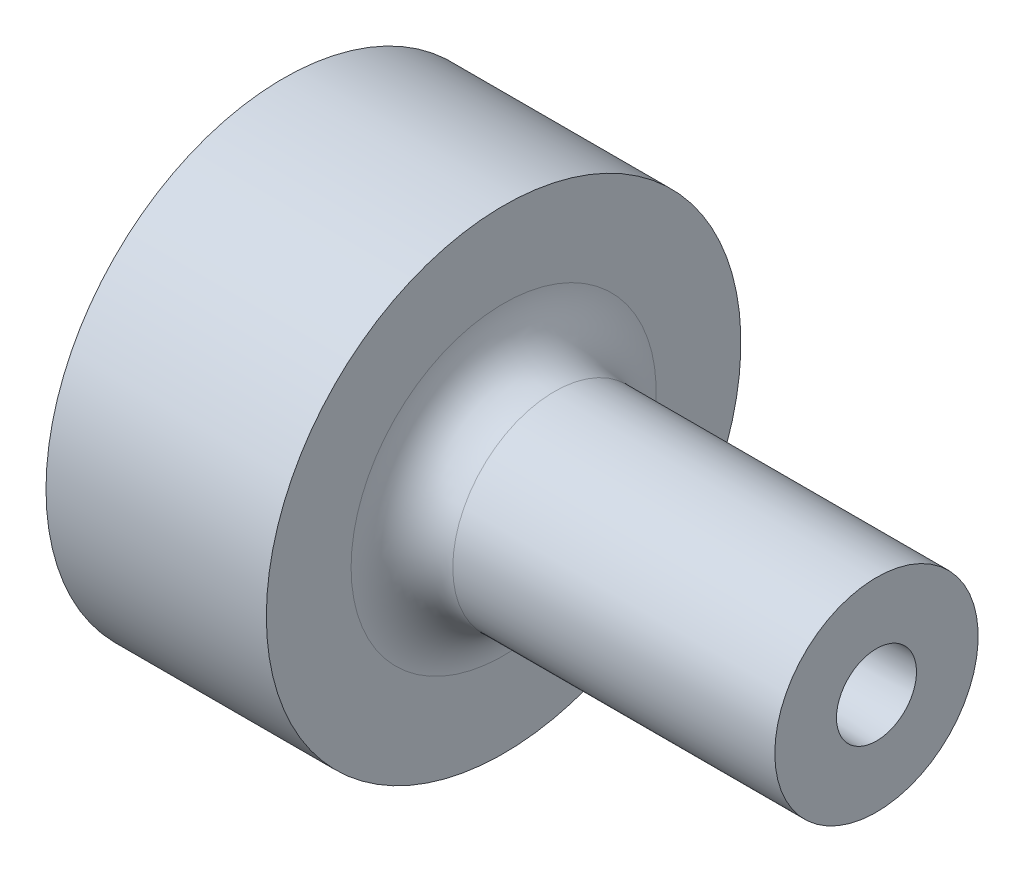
ISO-10303-21;
HEADER;
FILE_DESCRIPTION(('STEP AP214'),'2;1');
FILE_NAME('part.step','',(''),(''),'','','');
FILE_SCHEMA(('AUTOMOTIVE_DESIGN { 1 0 10303 214 1 1 1 1 }'));
ENDSEC;
DATA;
#1=APPLICATION_CONTEXT('core data for automotive mechanical design processes');
#2=APPLICATION_PROTOCOL_DEFINITION('international standard','automotive_design',2000,#1);
#3=PRODUCT_CONTEXT('',#1,'mechanical');
#4=PRODUCT('Part','Part','',(#3));
#5=PRODUCT_RELATED_PRODUCT_CATEGORY('part','',(#4));
#6=PRODUCT_DEFINITION_FORMATION('','',#4);
#7=PRODUCT_DEFINITION_CONTEXT('part definition',#1,'design');
#8=PRODUCT_DEFINITION('design','',#6,#7);
#9=PRODUCT_DEFINITION_SHAPE('','',#8);
#10=(LENGTH_UNIT() NAMED_UNIT(*) SI_UNIT(.MILLI.,.METRE.));
#11=(NAMED_UNIT(*) PLANE_ANGLE_UNIT() SI_UNIT($,.RADIAN.));
#12=(NAMED_UNIT(*) SI_UNIT($,.STERADIAN.) SOLID_ANGLE_UNIT());
#13=UNCERTAINTY_MEASURE_WITH_UNIT(LENGTH_MEASURE(1.E-05),#10,'distance_accuracy_value','');
#14=(GEOMETRIC_REPRESENTATION_CONTEXT(3) GLOBAL_UNCERTAINTY_ASSIGNED_CONTEXT((#13)) GLOBAL_UNIT_ASSIGNED_CONTEXT((#10,
#11,#12)) REPRESENTATION_CONTEXT('',''));
#15=CARTESIAN_POINT('',(0.,0.,0.));
#16=DIRECTION('',(0.,0.,1.));
#17=DIRECTION('',(1.,0.,0.));
#18=AXIS2_PLACEMENT_3D('',#15,#16,#17);
#19=CARTESIAN_POINT('',(0.,0.,0.));
#20=DIRECTION('',(-1.,0.,0.));
#21=DIRECTION('',(0.,0.,1.));
#22=AXIS2_PLACEMENT_3D('',#19,#20,#21);
#23=CYLINDRICAL_SURFACE('',#22,14.);
#24=CARTESIAN_POINT('',(13.,0.,0.));
#25=DIRECTION('',(-1.,0.,0.));
#26=DIRECTION('',(0.,0.,1.));
#27=AXIS2_PLACEMENT_3D('',#24,#25,#26);
#28=CIRCLE('',#27,14.);
#29=CARTESIAN_POINT('',(13.,0.,14.));
#30=VERTEX_POINT('',#29);
#31=EDGE_CURVE('E89',#30,#30,#28,.T.);
#32=ORIENTED_EDGE('',*,*,#31,.T.);
#33=EDGE_LOOP('',(#32));
#34=FACE_BOUND('',#33,.T.);
#35=CARTESIAN_POINT('',(0.,0.,0.));
#36=DIRECTION('',(-1.,0.,0.));
#37=DIRECTION('',(0.,0.,1.));
#38=AXIS2_PLACEMENT_3D('',#35,#36,#37);
#39=CIRCLE('',#38,14.);
#40=CARTESIAN_POINT('',(0.,0.,14.));
#41=VERTEX_POINT('',#40);
#42=EDGE_CURVE('E84',#41,#41,#39,.T.);
#43=ORIENTED_EDGE('',*,*,#42,.F.);
#44=EDGE_LOOP('',(#43));
#45=FACE_BOUND('',#44,.T.);
#46=CARTESIAN_POINT('',(6.5,-13.856406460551,-2.));
#47=CARTESIAN_POINT('',(6.61172417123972,-13.8564082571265,-1.99999534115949));
#48=CARTESIAN_POINT('',(6.72351471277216,-13.8577723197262,-1.99060664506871));
#49=CARTESIAN_POINT('',(6.9439746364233,-13.8630779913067,-1.95330740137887));
#50=CARTESIAN_POINT('',(7.05264079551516,-13.8670221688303,-1.92537839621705));
#51=CARTESIAN_POINT('',(7.26362870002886,-13.8770324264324,-1.85184738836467));
#52=CARTESIAN_POINT('',(7.36595507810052,-13.8830969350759,-1.80625847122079));
#53=CARTESIAN_POINT('',(7.56148972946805,-13.8966626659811,-1.69873175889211));
#54=CARTESIAN_POINT('',(7.65469934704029,-13.9041636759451,-1.63679637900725));
#55=CARTESIAN_POINT('',(7.83004829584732,-13.9198182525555,-1.49785346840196));
#56=CARTESIAN_POINT('',(7.91211171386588,-13.9279757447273,-1.42075056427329));
#57=CARTESIAN_POINT('',(8.06218155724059,-13.9439890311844,-1.25386707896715));
#58=CARTESIAN_POINT('',(8.13018723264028,-13.9518448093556,-1.16408582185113));
#59=CARTESIAN_POINT('',(8.25048909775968,-13.9664103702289,-0.973910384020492));
#60=CARTESIAN_POINT('',(8.30271571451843,-13.9731150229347,-0.873471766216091));
#61=CARTESIAN_POINT('',(8.38953073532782,-13.9845795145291,-0.665136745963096));
#62=CARTESIAN_POINT('',(8.4241199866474,-13.9893394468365,-0.557240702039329));
#63=CARTESIAN_POINT('',(8.47444920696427,-13.9963505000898,-0.337834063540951));
#64=CARTESIAN_POINT('',(8.49031606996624,-13.9986185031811,-0.226353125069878));
#65=CARTESIAN_POINT('',(8.5031438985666,-14.0004479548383,-0.00228956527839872));
#66=CARTESIAN_POINT('',(8.50010582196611,-14.0000095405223,0.110292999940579));
#67=CARTESIAN_POINT('',(8.47531062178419,-13.9964890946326,0.33249899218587));
#68=CARTESIAN_POINT('',(8.45369000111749,-13.9934263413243,0.442137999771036));
#69=CARTESIAN_POINT('',(8.39255744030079,-13.9850228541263,0.656215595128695));
#70=CARTESIAN_POINT('',(8.3530450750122,-13.9796820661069,0.760654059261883));
#71=CARTESIAN_POINT('',(8.25710925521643,-13.9672894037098,0.961781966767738));
#72=CARTESIAN_POINT('',(8.20062784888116,-13.9602316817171,1.05844339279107));
#73=CARTESIAN_POINT('',(8.07239950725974,-13.9451926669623,1.24096782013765));
#74=CARTESIAN_POINT('',(8.00065165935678,-13.9372113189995,1.32683017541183));
#75=CARTESIAN_POINT('',(7.843165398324,-13.921132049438,1.48612299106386));
#76=CARTESIAN_POINT('',(7.75730786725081,-13.9130337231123,1.55943569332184));
#77=CARTESIAN_POINT('',(7.57444547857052,-13.8977029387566,1.69062989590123));
#78=CARTESIAN_POINT('',(7.47744056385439,-13.890470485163,1.74851131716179));
#79=CARTESIAN_POINT('',(7.27491971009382,-13.8776905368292,1.84721301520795));
#80=CARTESIAN_POINT('',(7.1693981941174,-13.8721441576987,1.88802200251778));
#81=CARTESIAN_POINT('',(6.95290242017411,-13.8633846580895,1.9513062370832));
#82=CARTESIAN_POINT('',(6.84192850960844,-13.8601713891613,1.97378265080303));
#83=CARTESIAN_POINT('',(6.61872346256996,-13.8564698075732,1.99960390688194));
#84=CARTESIAN_POINT('',(6.50651197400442,-13.8559577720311,2.00311531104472));
#85=CARTESIAN_POINT('',(6.28310219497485,-13.8576537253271,1.9913480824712));
#86=CARTESIAN_POINT('',(6.17190387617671,-13.8598616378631,1.9760699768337));
#87=CARTESIAN_POINT('',(5.95418781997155,-13.8667269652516,1.92729837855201));
#88=CARTESIAN_POINT('',(5.84765127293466,-13.8713733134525,1.8938871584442));
#89=CARTESIAN_POINT('',(5.6416912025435,-13.8825829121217,1.80988306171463));
#90=CARTESIAN_POINT('',(5.54226800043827,-13.8891462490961,1.75928940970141));
#91=CARTESIAN_POINT('',(5.35260812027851,-13.9035064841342,1.64195360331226));
#92=CARTESIAN_POINT('',(5.26243903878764,-13.911311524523,1.57510320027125));
#93=CARTESIAN_POINT('',(5.09454027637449,-13.9272509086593,1.42730277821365));
#94=CARTESIAN_POINT('',(5.01681123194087,-13.9353852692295,1.34635203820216));
#95=CARTESIAN_POINT('',(4.8754047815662,-13.9511405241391,1.17191708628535));
#96=CARTESIAN_POINT('',(4.81183747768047,-13.9587570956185,1.07834317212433));
#97=CARTESIAN_POINT('',(4.70132443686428,-13.972552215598,0.881748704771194));
#98=CARTESIAN_POINT('',(4.65437828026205,-13.9787308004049,0.778728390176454));
#99=CARTESIAN_POINT('',(4.57861788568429,-13.9889347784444,0.566515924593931));
#100=CARTESIAN_POINT('',(4.54974241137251,-13.9929674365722,0.457345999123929));
#101=CARTESIAN_POINT('',(4.51074453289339,-13.9984555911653,0.235645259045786));
#102=CARTESIAN_POINT('',(4.50062101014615,-13.9999112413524,0.123114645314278));
#103=CARTESIAN_POINT('',(4.49943976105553,-14.0000800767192,-0.101043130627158));
#104=CARTESIAN_POINT('',(4.50821318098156,-13.998817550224,-0.212669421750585));
#105=CARTESIAN_POINT('',(4.54421615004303,-13.9937406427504,-0.432842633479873));
#106=CARTESIAN_POINT('',(4.57144565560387,-13.989926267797,-0.541389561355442));
#107=CARTESIAN_POINT('',(4.6435299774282,-13.9801722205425,-0.752283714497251));
#108=CARTESIAN_POINT('',(4.68837418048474,-13.9742338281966,-0.854634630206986));
#109=CARTESIAN_POINT('',(4.79439714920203,-13.960885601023,-1.05038570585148));
#110=CARTESIAN_POINT('',(4.8555763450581,-13.9534757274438,-1.14378562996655));
#111=CARTESIAN_POINT('',(4.99314771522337,-13.9379304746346,-1.31984194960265));
#112=CARTESIAN_POINT('',(5.06966490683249,-13.9297894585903,-1.40240016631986));
#113=CARTESIAN_POINT('',(5.2354775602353,-13.9137422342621,-1.55356716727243));
#114=CARTESIAN_POINT('',(5.32477602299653,-13.9058360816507,-1.6221726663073));
#115=CARTESIAN_POINT('',(5.51414543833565,-13.8911108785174,-1.74379523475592));
#116=CARTESIAN_POINT('',(5.61426869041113,-13.8842975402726,-1.79673154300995));
#117=CARTESIAN_POINT('',(5.82203229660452,-13.8725962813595,-1.88495902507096));
#118=CARTESIAN_POINT('',(5.92966459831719,-13.8677063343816,-1.92026877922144));
#119=CARTESIAN_POINT('',(6.11483642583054,-13.8615529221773,-1.96409255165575));
#120=CARTESIAN_POINT('',(6.19122433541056,-13.859633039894,-1.97753762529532));
#121=CARTESIAN_POINT('',(6.34506419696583,-13.857059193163,-1.99549291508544));
#122=CARTESIAN_POINT('',(6.42251613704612,-13.8564052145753,-2.00000323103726));
#123=CARTESIAN_POINT('',(6.5,-13.856406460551,-2.));
#124=B_SPLINE_CURVE_WITH_KNOTS('',3,(#46,#47,#48,#49,#50,#51,#52,#53,#54,#55,#56,#57,#58,#59,
#60,#61,#62,#63,#64,#65,#66,#67,#68,#69,#70,#71,#72,#73,#74,#75,#76,#77,#78,#79,#80,#81,#82,#83,
#84,#85,#86,#87,#88,#89,#90,#91,#92,#93,#94,#95,#96,#97,#98,#99,#100,#101,#102,#103,#104,#105,
#106,#107,#108,#109,#110,#111,#112,#113,#114,#115,#116,#117,#118,#119,#120,#121,#122,#123),
.UNSPECIFIED.,.T.,.F.,(4,2,2,2,2,2,2,2,2,2,2,2,2,2,2,2,2,2,2,2,2,2,2,2,2,2,2,2,2,2,2,2,2,2,2,2,
2,2,4),(0.,0.334889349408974,0.670112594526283,1.00508792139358,1.34001378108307,
1.6771171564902,2.01423851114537,2.35282530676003,2.6913958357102,3.02765822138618,
3.36390357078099,3.69769984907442,4.03150405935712,4.36646147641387,4.70143892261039,
5.03940517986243,5.37737316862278,5.7155642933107,6.05373389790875,6.3889286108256,
6.72411392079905,7.05779100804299,7.39148315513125,7.72746121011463,8.06345644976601,
8.40197921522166,8.74049343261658,9.07785422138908,9.41519488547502,9.74953375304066,
10.083871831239,10.4180087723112,10.7521545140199,11.0891434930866,11.426211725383,
11.7649881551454,12.103406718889,12.3356645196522,12.5679197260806),.UNSPECIFIED.);
#125=CARTESIAN_POINT('',(6.5,-13.856406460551,-2.));
#126=VERTEX_POINT('',#125);
#127=EDGE_CURVE('E10',#126,#126,#124,.T.);
#128=ORIENTED_EDGE('',*,*,#127,.F.);
#129=EDGE_LOOP('',(#128));
#130=FACE_BOUND('',#129,.T.);
#131=ADVANCED_FACE('F16',(#34,#45,#130),#23,.T.);
#132=CARTESIAN_POINT('',(0.,0.,0.));
#133=DIRECTION('',(1.,0.,0.));
#134=DIRECTION('',(0.,0.,-1.));
#135=AXIS2_PLACEMENT_3D('',#132,#133,#134);
#136=CONICAL_SURFACE('',#135,1.75,0.0174532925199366);
#137=CARTESIAN_POINT('',(35.,0.,0.));
#138=DIRECTION('',(-1.,0.,0.));
#139=DIRECTION('',(0.,0.,1.));
#140=AXIS2_PLACEMENT_3D('',#137,#138,#139);
#141=CIRCLE('',#140,2.36092727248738);
#142=CARTESIAN_POINT('',(35.,0.,2.36092727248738));
#143=VERTEX_POINT('',#142);
#144=EDGE_CURVE('E81',#143,#143,#141,.T.);
#145=ORIENTED_EDGE('',*,*,#144,.F.);
#146=EDGE_LOOP('',(#145));
#147=FACE_BOUND('',#146,.T.);
#148=CARTESIAN_POINT('',(1.08679639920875,0.,0.));
#149=DIRECTION('',(-1.,0.,0.));
#150=DIRECTION('',(0.,0.,1.));
#151=AXIS2_PLACEMENT_3D('',#148,#149,#150);
#152=CIRCLE('',#151,1.76897010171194);
#153=CARTESIAN_POINT('',(1.08679639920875,0.,1.76897010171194));
#154=VERTEX_POINT('',#153);
#155=EDGE_CURVE('E94',#154,#154,#152,.F.);
#156=ORIENTED_EDGE('',*,*,#155,.F.);
#157=EDGE_LOOP('',(#156));
#158=FACE_BOUND('',#157,.T.);
#159=ADVANCED_FACE('F45',(#147,#158),#136,.F.);
#160=CARTESIAN_POINT('',(16.,0.,0.));
#161=DIRECTION('',(-1.,0.,0.));
#162=DIRECTION('',(0.,0.,1.));
#163=AXIS2_PLACEMENT_3D('',#160,#161,#162);
#164=TOROIDAL_SURFACE('',#163,9.,3.);
#165=CARTESIAN_POINT('',(13.,0.,0.));
#166=DIRECTION('',(-1.,0.,0.));
#167=DIRECTION('',(0.,0.,1.));
#168=AXIS2_PLACEMENT_3D('',#165,#166,#167);
#169=CIRCLE('',#168,9.);
#170=CARTESIAN_POINT('',(13.,0.,9.));
#171=VERTEX_POINT('',#170);
#172=EDGE_CURVE('E91',#171,#171,#169,.T.);
#173=ORIENTED_EDGE('',*,*,#172,.F.);
#174=EDGE_LOOP('',(#173));
#175=FACE_BOUND('',#174,.T.);
#176=CARTESIAN_POINT('',(16.,0.,0.));
#177=DIRECTION('',(-1.,0.,0.));
#178=DIRECTION('',(0.,0.,1.));
#179=AXIS2_PLACEMENT_3D('',#176,#177,#178);
#180=CIRCLE('',#179,6.);
#181=CARTESIAN_POINT('',(16.,0.,6.));
#182=VERTEX_POINT('',#181);
#183=EDGE_CURVE('E28',#182,#182,#180,.T.);
#184=ORIENTED_EDGE('',*,*,#183,.T.);
#185=EDGE_LOOP('',(#184));
#186=FACE_BOUND('',#185,.T.);
#187=ADVANCED_FACE('F18',(#175,#186),#164,.F.);
#188=CARTESIAN_POINT('',(0.,0.,0.));
#189=DIRECTION('',(-1.,0.,0.));
#190=DIRECTION('',(0.,0.,1.));
#191=AXIS2_PLACEMENT_3D('',#188,#189,#190);
#192=CYLINDRICAL_SURFACE('',#191,6.);
#193=ORIENTED_EDGE('',*,*,#183,.F.);
#194=EDGE_LOOP('',(#193));
#195=FACE_BOUND('',#194,.T.);
#196=CARTESIAN_POINT('',(35.,0.,0.));
#197=DIRECTION('',(-1.,0.,0.));
#198=DIRECTION('',(0.,0.,1.));
#199=AXIS2_PLACEMENT_3D('',#196,#197,#198);
#200=CIRCLE('',#199,6.);
#201=CARTESIAN_POINT('',(35.,0.,6.));
#202=VERTEX_POINT('',#201);
#203=EDGE_CURVE('E80',#202,#202,#200,.T.);
#204=ORIENTED_EDGE('',*,*,#203,.T.);
#205=EDGE_LOOP('',(#204));
#206=FACE_BOUND('',#205,.T.);
#207=ADVANCED_FACE('F66',(#195,#206),#192,.T.);
#208=CARTESIAN_POINT('',(35.,6.,0.));
#209=DIRECTION('',(-1.,0.,0.));
#210=DIRECTION('',(0.,0.,1.));
#211=AXIS2_PLACEMENT_3D('',#208,#209,#210);
#212=PLANE('',#211);
#213=ORIENTED_EDGE('',*,*,#203,.F.);
#214=EDGE_LOOP('',(#213));
#215=FACE_BOUND('',#214,.T.);
#216=ORIENTED_EDGE('',*,*,#144,.T.);
#217=EDGE_LOOP('',(#216));
#218=FACE_BOUND('',#217,.T.);
#219=ADVANCED_FACE('F62',(#215,#218),#212,.F.);
#220=CARTESIAN_POINT('',(0.,1.75,0.));
#221=DIRECTION('',(1.,0.,0.));
#222=DIRECTION('',(0.,0.,-1.));
#223=AXIS2_PLACEMENT_3D('',#220,#221,#222);
#224=PLANE('',#223);
#225=CARTESIAN_POINT('',(0.,0.,0.));
#226=DIRECTION('',(-1.,0.,0.));
#227=DIRECTION('',(0.,0.,1.));
#228=AXIS2_PLACEMENT_3D('',#225,#226,#227);
#229=CIRCLE('',#228,5.);
#230=CARTESIAN_POINT('',(0.,0.,5.));
#231=VERTEX_POINT('',#230);
#232=EDGE_CURVE('E97',#231,#231,#229,.T.);
#233=ORIENTED_EDGE('',*,*,#232,.F.);
#234=EDGE_LOOP('',(#233));
#235=FACE_BOUND('',#234,.T.);
#236=ORIENTED_EDGE('',*,*,#42,.T.);
#237=EDGE_LOOP('',(#236));
#238=FACE_BOUND('',#237,.T.);
#239=ADVANCED_FACE('F60',(#235,#238),#224,.F.);
#240=CARTESIAN_POINT('',(13.,14.,0.));
#241=DIRECTION('',(-1.,0.,0.));
#242=DIRECTION('',(0.,0.,1.));
#243=AXIS2_PLACEMENT_3D('',#240,#241,#242);
#244=PLANE('',#243);
#245=ORIENTED_EDGE('',*,*,#31,.F.);
#246=EDGE_LOOP('',(#245));
#247=FACE_BOUND('',#246,.T.);
#248=ORIENTED_EDGE('',*,*,#172,.T.);
#249=EDGE_LOOP('',(#248));
#250=FACE_BOUND('',#249,.T.);
#251=ADVANCED_FACE('F58',(#247,#250),#244,.F.);
#252=CARTESIAN_POINT('',(-37.3349076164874,0.,0.));
#253=DIRECTION('',(-1.,0.,0.));
#254=DIRECTION('',(0.,0.,1.));
#255=AXIS2_PLACEMENT_3D('',#252,#253,#254);
#256=DEGENERATE_TOROIDAL_SURFACE('',#255,9.35634609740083,40.,.F.);
#257=ORIENTED_EDGE('',*,*,#232,.T.);
#258=EDGE_LOOP('',(#257));
#259=FACE_BOUND('',#258,.T.);
#260=ORIENTED_EDGE('',*,*,#155,.T.);
#261=EDGE_LOOP('',(#260));
#262=FACE_BOUND('',#261,.T.);
#263=ADVANCED_FACE('F41',(#259,#262),#256,.T.);
#264=CARTESIAN_POINT('',(6.5,-14.,0.));
#265=DIRECTION('',(0.,-1.,0.));
#266=DIRECTION('',(0.,0.,-1.));
#267=AXIS2_PLACEMENT_3D('',#264,#265,#266);
#268=CYLINDRICAL_SURFACE('',#267,2.);
#269=CARTESIAN_POINT('',(6.5,-8.,0.));
#270=DIRECTION('',(0.,-1.,0.));
#271=DIRECTION('',(0.,0.,-1.));
#272=AXIS2_PLACEMENT_3D('',#269,#270,#271);
#273=CIRCLE('',#272,2.);
#274=CARTESIAN_POINT('',(6.5,-8.,-2.));
#275=VERTEX_POINT('',#274);
#276=EDGE_CURVE('E100',#275,#275,#273,.T.);
#277=ORIENTED_EDGE('',*,*,#276,.F.);
#278=EDGE_LOOP('',(#277));
#279=FACE_BOUND('',#278,.T.);
#280=ORIENTED_EDGE('',*,*,#127,.T.);
#281=EDGE_LOOP('',(#280));
#282=FACE_BOUND('',#281,.T.);
#283=ADVANCED_FACE('F33',(#279,#282),#268,.F.);
#284=CARTESIAN_POINT('',(6.5,-6.84529946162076,0.));
#285=DIRECTION('',(0.,-1.,0.));
#286=DIRECTION('',(0.,0.,-1.));
#287=AXIS2_PLACEMENT_3D('',#284,#285,#286);
#288=CONICAL_SURFACE('',#287,0.,1.0471975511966);
#289=ORIENTED_EDGE('',*,*,#276,.T.);
#290=EDGE_LOOP('',(#289));
#291=FACE_BOUND('',#290,.T.);
#292=CARTESIAN_POINT('',(6.5,-6.84529946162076,0.));
#293=VERTEX_POINT('',#292);
#294=VERTEX_LOOP('',#293);
#295=FACE_BOUND('',#294,.T.);
#296=ADVANCED_FACE('F31',(#291,#295),#288,.F.);
#297=CLOSED_SHELL('',(#131,#159,#187,#207,#219,#239,#251,#263,#283,#296));
#298=MANIFOLD_SOLID_BREP('B1',#297);
#299=ADVANCED_BREP_SHAPE_REPRESENTATION('',(#18,#298),#14);
#300=SHAPE_DEFINITION_REPRESENTATION(#9,#299);
ENDSEC;
END-ISO-10303-21;
